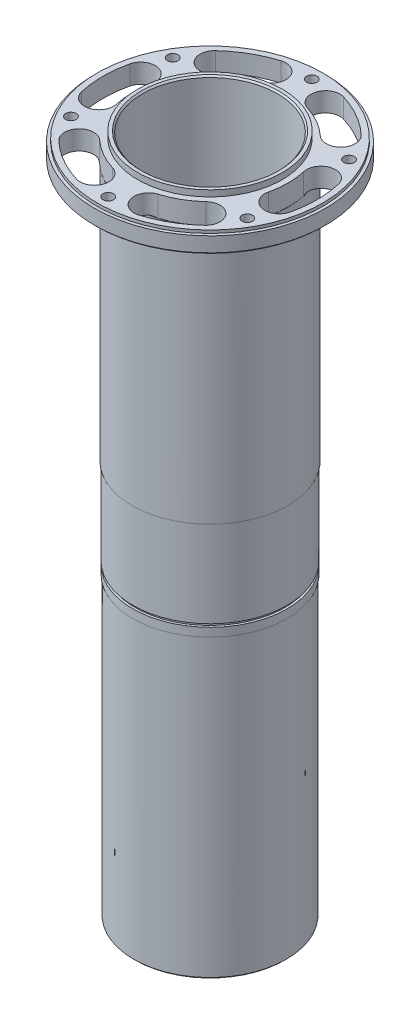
from build123d import *

# Parameters (mm, degrees)
F_8_32_TAPPED_HOLE2_D     = 3.4544
F_8_32_TAPPED_HOLE2_DEPTH = 10.668
FILLET1_R                 = 0.762
CUT_EXTRUDE1_REACH        = 230.688
CIRPATTERN1_COUNT         = 6
CIRPATTERN2_COUNT         = 6
CHAMFER1_SIZE             = 0.508


with BuildPart() as part:
    # Sketch1 → Revolve1 (revolve)
    with BuildSketch(Plane.XY, mode=Mode.PRIVATE) as revolve1_sk:
        Polygon((-23.8125, 0), (-37.1348, 0), (-37.1348, -0.9906), (-38.1, -0.9906), (-38.1, -6.35), (-25.654, -6.35), (-25.654, -92.075), (-25.4, -92.075), (-25.4, -120.65), (-24.6761, -120.65), (-24.6761, -121.6406), (-25.4, -121.6406), (-25.4, -124.46), (-25.146, -124.46), (-25.146, -222.25), (-22.225, -222.25), (-22.225, 2.032), (-23.8125, 2.032), align=None)
    revolve(revolve1_sk.sketch.rotate(Axis((0, 0, 0), (0, 1, 0)), 270), axis=Axis((0, 0, 0), (0, 1, 0)))

    # 8-32 Tapped Hole2
    with Locations(Plane(origin=(0, 0, 0), x_dir=(1, 0, 0), z_dir=(0, 1, 0))):
        with Locations((29.036099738, -16.764)):
            f_8_32_tapped_hole2 = Hole(F_8_32_TAPPED_HOLE2_D / 2, depth=F_8_32_TAPPED_HOLE2_DEPTH)

    # Fillet1
    fillet1_edges = [part.edges().sort_by_distance(p)[0] for p in [
        (0, -6.35, 25.654),
    ]]
    fillet(fillet1_edges, radius=FILLET1_R)

    # Sketch11 → Cut-Extrude1 (cut, up to next)
    with BuildSketch(Plane(origin=(0, 0, 0), x_dir=(1, 0, 0), z_dir=(0, 1, 0)), mode=Mode.PRIVATE) as cut_extrude1_sk1:
        with BuildLine():
            ThreePointArc((24.043988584, -25.784021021), (24.279670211, -19.034982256), (17.530631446, -18.799300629))
            ThreePointArc((17.530631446, -18.799300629), (12.8524, -22.261009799), (7.515356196, -24.581622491))
            ThreePointArc((7.515356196, -24.581622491), (4.344943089, -30.544302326), (10.307622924, -33.714715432))
            ThreePointArc((10.307622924, -33.714715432), (17.6276, -30.531898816), (24.043988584, -25.784021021))
        make_face()
    cut_extrude1_tool1 = extrude(cut_extrude1_sk1.sketch, amount=-CUT_EXTRUDE1_REACH, mode=Mode.PRIVATE) & part.part
    cut_extrude1 = cut_extrude1_tool1.solids().sort_by_distance((15.018093, 0, 26.0121))[0]
    add(cut_extrude1, mode=Mode.SUBTRACT)

    # CirPattern1: 8-32 Tapped Hole2 ×6 about axis
    cirpattern1_axis = Axis((0, 0, 0), (0, 1, 0))
    for i in range(1, CIRPATTERN1_COUNT):
        add(f_8_32_tapped_hole2.rotate(cirpattern1_axis, i * 360 / CIRPATTERN1_COUNT), mode=Mode.SUBTRACT)

    # CirPattern2: Cut-Extrude1 ×6 about axis
    cirpattern2_axis = Axis((0, 0, 0), (0, 1, 0))
    for i in range(1, CIRPATTERN2_COUNT):
        add(cut_extrude1.rotate(cirpattern2_axis, i * 360 / CIRPATTERN2_COUNT), mode=Mode.SUBTRACT)

    # Chamfer1
    chamfer1_edges = [part.edges().sort_by_distance(p)[0] for p in [
        (0, -6.35, 38.1),
        (0, -222.25, 25.146),
        (0, -222.25, 22.225),
        (0, 2.032, 22.225),
    ]]
    chamfer(chamfer1_edges, length=CHAMFER1_SIZE)


solid = part.part
